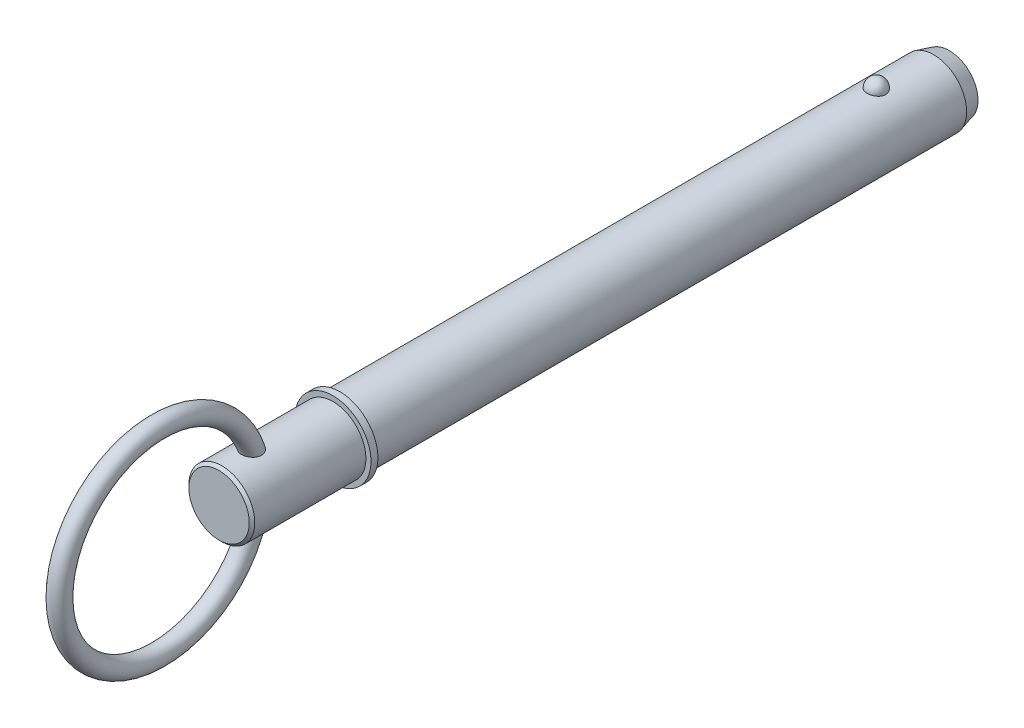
ISO-10303-21;
HEADER;
FILE_DESCRIPTION(('STEP AP214'),'2;1');
FILE_NAME('part.step','',(''),(''),'','','');
FILE_SCHEMA(('AUTOMOTIVE_DESIGN { 1 0 10303 214 1 1 1 1 }'));
ENDSEC;
DATA;
#1=APPLICATION_CONTEXT('core data for automotive mechanical design processes');
#2=APPLICATION_PROTOCOL_DEFINITION('international standard','automotive_design',2000,#1);
#3=PRODUCT_CONTEXT('',#1,'mechanical');
#4=PRODUCT('Part','Part','',(#3));
#5=PRODUCT_RELATED_PRODUCT_CATEGORY('part','',(#4));
#6=PRODUCT_DEFINITION_FORMATION('','',#4);
#7=PRODUCT_DEFINITION_CONTEXT('part definition',#1,'design');
#8=PRODUCT_DEFINITION('design','',#6,#7);
#9=PRODUCT_DEFINITION_SHAPE('','',#8);
#10=(LENGTH_UNIT() NAMED_UNIT(*) SI_UNIT(.MILLI.,.METRE.));
#11=(NAMED_UNIT(*) PLANE_ANGLE_UNIT() SI_UNIT($,.RADIAN.));
#12=(NAMED_UNIT(*) SI_UNIT($,.STERADIAN.) SOLID_ANGLE_UNIT());
#13=UNCERTAINTY_MEASURE_WITH_UNIT(LENGTH_MEASURE(1.E-05),#10,'distance_accuracy_value','');
#14=(GEOMETRIC_REPRESENTATION_CONTEXT(3) GLOBAL_UNCERTAINTY_ASSIGNED_CONTEXT((#13)) GLOBAL_UNIT_ASSIGNED_CONTEXT((#10,
#11,#12)) REPRESENTATION_CONTEXT('',''));
#15=CARTESIAN_POINT('',(0.,0.,0.));
#16=DIRECTION('',(0.,0.,1.));
#17=DIRECTION('',(1.,0.,0.));
#18=AXIS2_PLACEMENT_3D('',#15,#16,#17);
#19=CARTESIAN_POINT('',(0.,0.,152.4));
#20=DIRECTION('',(0.,0.,-1.));
#21=DIRECTION('',(-1.,0.,0.));
#22=AXIS2_PLACEMENT_3D('',#19,#20,#21);
#23=CYLINDRICAL_SURFACE('',#22,9.525);
#24=CARTESIAN_POINT('',(2.66304631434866,9.14515223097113,-2.68999999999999));
#25=CARTESIAN_POINT('',(2.66304388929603,9.14515434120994,-2.53964785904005));
#26=CARTESIAN_POINT('',(2.65079171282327,9.14874785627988,-2.38926509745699));
#27=CARTESIAN_POINT('',(2.60207590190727,9.16272073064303,-2.09276319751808));
#28=CARTESIAN_POINT('',(2.5656035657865,9.17310252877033,-1.94664561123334));
#29=CARTESIAN_POINT('',(2.469373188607,9.19947238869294,-1.66290124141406));
#30=CARTESIAN_POINT('',(2.40962536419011,9.215457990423,-1.52527076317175));
#31=CARTESIAN_POINT('',(2.26832639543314,9.25124900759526,-1.26225231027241));
#32=CARTESIAN_POINT('',(2.1867756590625,9.27105435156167,-1.1368641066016));
#33=CARTESIAN_POINT('',(2.00344089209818,9.3123948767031,-0.901158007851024));
#34=CARTESIAN_POINT('',(1.90155748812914,9.33393823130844,-0.790918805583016));
#35=CARTESIAN_POINT('',(1.68043702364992,9.37626794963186,-0.589299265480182));
#36=CARTESIAN_POINT('',(1.56119995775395,9.397054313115,-0.497918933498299));
#37=CARTESIAN_POINT('',(1.30893044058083,9.43549335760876,-0.336812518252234));
#38=CARTESIAN_POINT('',(1.17593917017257,9.45315498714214,-0.267024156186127));
#39=CARTESIAN_POINT('',(0.899596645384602,9.48344056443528,-0.150749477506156));
#40=CARTESIAN_POINT('',(0.756246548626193,9.49606507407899,-0.104260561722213));
#41=CARTESIAN_POINT('',(0.466048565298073,9.51468193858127,-0.0365733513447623));
#42=CARTESIAN_POINT('',(0.319312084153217,9.52079100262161,-0.0149294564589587));
#43=CARTESIAN_POINT('',(0.0241592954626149,9.52611235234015,0.0039533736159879));
#44=CARTESIAN_POINT('',(-0.12425684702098,9.5253253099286,0.00119468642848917));
#45=CARTESIAN_POINT('',(-0.416281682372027,9.51700443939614,-0.0284230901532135));
#46=CARTESIAN_POINT('',(-0.559928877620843,9.50956858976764,-0.0549321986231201));
#47=CARTESIAN_POINT('',(-0.840604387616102,9.48887888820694,-0.130816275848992));
#48=CARTESIAN_POINT('',(-0.977632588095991,9.47562493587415,-0.180191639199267));
#49=CARTESIAN_POINT('',(-1.24212223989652,9.44460733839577,-0.300803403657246));
#50=CARTESIAN_POINT('',(-1.36952298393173,9.42681774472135,-0.372166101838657));
#51=CARTESIAN_POINT('',(-1.61053183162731,9.38864858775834,-0.534729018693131));
#52=CARTESIAN_POINT('',(-1.72413851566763,9.36826875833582,-0.625931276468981));
#53=CARTESIAN_POINT('',(-1.9367483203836,9.32666137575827,-0.827716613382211));
#54=CARTESIAN_POINT('',(-2.03542624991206,9.3054250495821,-0.938640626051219));
#55=CARTESIAN_POINT('',(-2.21301001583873,9.26480083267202,-1.17562728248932));
#56=CARTESIAN_POINT('',(-2.29191442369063,9.24541307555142,-1.3016910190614));
#57=CARTESIAN_POINT('',(-2.4288038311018,9.21040769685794,-1.56709947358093));
#58=CARTESIAN_POINT('',(-2.48653332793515,9.19483682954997,-1.70658229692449));
#59=CARTESIAN_POINT('',(-2.57830950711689,9.16952722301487,-1.99363485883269));
#60=CARTESIAN_POINT('',(-2.61235688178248,9.1597883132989,-2.14120436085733));
#61=CARTESIAN_POINT('',(-2.65582131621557,9.14728131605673,-2.43957517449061));
#62=CARTESIAN_POINT('',(-2.66534248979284,9.14448376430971,-2.59036007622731));
#63=CARTESIAN_POINT('',(-2.659816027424,9.1460926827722,-2.89143694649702));
#64=CARTESIAN_POINT('',(-2.64476907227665,9.15049895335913,-3.04172892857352));
#65=CARTESIAN_POINT('',(-2.59062526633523,9.16597303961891,-3.3367616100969));
#66=CARTESIAN_POINT('',(-2.55165119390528,9.17700684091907,-3.48152666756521));
#67=CARTESIAN_POINT('',(-2.45072334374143,9.20447158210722,-3.7622672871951));
#68=CARTESIAN_POINT('',(-2.38876863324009,9.22090274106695,-3.89824249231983));
#69=CARTESIAN_POINT('',(-2.24300082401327,9.25744165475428,-4.15838266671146));
#70=CARTESIAN_POINT('',(-2.15906901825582,9.27756919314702,-4.28247834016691));
#71=CARTESIAN_POINT('',(-1.97161008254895,9.31920445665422,-4.51460755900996));
#72=CARTESIAN_POINT('',(-1.86808218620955,9.34071223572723,-4.62264047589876));
#73=CARTESIAN_POINT('',(-1.64365852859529,9.38280712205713,-4.82005417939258));
#74=CARTESIAN_POINT('',(-1.52269814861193,9.40339041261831,-4.90936239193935));
#75=CARTESIAN_POINT('',(-1.26696810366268,9.44124442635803,-5.06628635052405));
#76=CARTESIAN_POINT('',(-1.1321994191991,9.45851538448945,-5.13390363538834));
#77=CARTESIAN_POINT('',(-0.854427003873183,9.48761400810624,-5.24478918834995));
#78=CARTESIAN_POINT('',(-0.711548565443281,9.49950757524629,-5.28835378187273));
#79=CARTESIAN_POINT('',(-0.420167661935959,9.51684639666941,-5.35116010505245));
#80=CARTESIAN_POINT('',(-0.271665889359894,9.52229244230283,-5.3704048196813));
#81=CARTESIAN_POINT('',(0.0236961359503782,9.52609381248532,-5.38387805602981));
#82=CARTESIAN_POINT('',(0.170533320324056,9.52458300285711,-5.37857884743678));
#83=CARTESIAN_POINT('',(0.461166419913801,9.51494050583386,-5.34419624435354));
#84=CARTESIAN_POINT('',(0.604962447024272,9.50680906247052,-5.31511372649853));
#85=CARTESIAN_POINT('',(0.884899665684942,9.48484202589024,-5.23415185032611));
#86=CARTESIAN_POINT('',(1.02106863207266,9.47102889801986,-5.18236222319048));
#87=CARTESIAN_POINT('',(1.28268503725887,9.43915933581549,-5.05742910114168));
#88=CARTESIAN_POINT('',(1.40813178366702,9.421102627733,-4.98428422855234));
#89=CARTESIAN_POINT('',(1.64690915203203,9.38233399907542,-4.8172920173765));
#90=CARTESIAN_POINT('',(1.76002050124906,9.36158508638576,-4.72313982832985));
#91=CARTESIAN_POINT('',(1.96897358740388,9.31987907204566,-4.51732444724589));
#92=CARTESIAN_POINT('',(2.06481234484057,9.29892193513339,-4.40565824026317));
#93=CARTESIAN_POINT('',(2.23837433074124,9.25869342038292,-4.16566572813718));
#94=CARTESIAN_POINT('',(2.31574652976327,9.23945848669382,-4.03707931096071));
#95=CARTESIAN_POINT('',(2.44818540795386,9.20525491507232,-3.76840633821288));
#96=CARTESIAN_POINT('',(2.50325979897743,9.19028480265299,-3.6283237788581));
#97=CARTESIAN_POINT('',(2.58510224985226,9.16757716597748,-3.35610038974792));
#98=CARTESIAN_POINT('',(2.61427951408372,9.15923447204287,-3.2247283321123));
#99=CARTESIAN_POINT('',(2.6532524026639,9.14802112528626,-2.95891229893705));
#100=CARTESIAN_POINT('',(2.66304848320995,9.1451503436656,-2.82446839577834));
#101=CARTESIAN_POINT('',(2.66304631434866,9.14515223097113,-2.68999999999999));
#102=B_SPLINE_CURVE_WITH_KNOTS('',3,(#24,#25,#26,#27,#28,#29,#30,#31,#32,#33,#34,#35,#36,#37,
#38,#39,#40,#41,#42,#43,#44,#45,#46,#47,#48,#49,#50,#51,#52,#53,#54,#55,#56,#57,#58,#59,#60,#61,
#62,#63,#64,#65,#66,#67,#68,#69,#70,#71,#72,#73,#74,#75,#76,#77,#78,#79,#80,#81,#82,#83,#84,#85,
#86,#87,#88,#89,#90,#91,#92,#93,#94,#95,#96,#97,#98,#99,#100,#101),.UNSPECIFIED.,.T.,.F.,(4,2,2,
2,2,2,2,2,2,2,2,2,2,2,2,2,2,2,2,2,2,2,2,2,2,2,2,2,2,2,2,2,2,2,2,2,2,2,4),(0.,0.450573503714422,
0.901308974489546,1.35184682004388,1.80237623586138,2.25516399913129,2.70795190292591,
3.15942136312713,3.61084044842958,4.0540301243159,4.49717661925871,4.9338984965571,
5.37062791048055,5.80991423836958,6.24924573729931,6.69708004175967,7.1449466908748,
7.5980522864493,8.0511446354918,8.50231041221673,8.95346368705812,9.40232106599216,
9.85119666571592,10.3025487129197,10.7539184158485,11.2070064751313,11.6600623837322,
12.1074045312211,12.5546917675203,12.9934085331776,13.4321091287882,13.8690915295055,
14.3061021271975,14.7499227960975,15.1938199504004,15.6455814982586,16.0971866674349,
16.5001694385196,16.9031427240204),.UNSPECIFIED.);
#103=CARTESIAN_POINT('',(2.66304631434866,9.14515223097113,-2.68999999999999));
#104=VERTEX_POINT('',#103);
#105=EDGE_CURVE('E100',#104,#104,#102,.T.);
#106=ORIENTED_EDGE('',*,*,#105,.T.);
#107=EDGE_LOOP('',(#106));
#108=FACE_BOUND('',#107,.T.);
#109=CARTESIAN_POINT('',(0.,0.,-19.3000000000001));
#110=DIRECTION('',(0.,0.,-1.));
#111=DIRECTION('',(-1.,0.,0.));
#112=AXIS2_PLACEMENT_3D('',#109,#110,#111);
#113=CIRCLE('',#112,9.525);
#114=CARTESIAN_POINT('',(-9.525,0.,-19.3000000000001));
#115=VERTEX_POINT('',#114);
#116=EDGE_CURVE('E108',#115,#115,#113,.F.);
#117=ORIENTED_EDGE('',*,*,#116,.T.);
#118=EDGE_LOOP('',(#117));
#119=FACE_BOUND('',#118,.T.);
#120=CARTESIAN_POINT('',(0.,0.,152.4));
#121=DIRECTION('',(0.,0.,1.));
#122=DIRECTION('',(1.,0.,0.));
#123=AXIS2_PLACEMENT_3D('',#120,#121,#122);
#124=CIRCLE('',#123,9.525);
#125=CARTESIAN_POINT('',(9.525,0.,152.4));
#126=VERTEX_POINT('',#125);
#127=EDGE_CURVE('E106',#126,#126,#124,.T.);
#128=ORIENTED_EDGE('',*,*,#127,.F.);
#129=EDGE_LOOP('',(#128));
#130=FACE_BOUND('',#129,.T.);
#131=ADVANCED_FACE('F39',(#108,#119,#130),#23,.T.);
#132=CARTESIAN_POINT('',(0.,0.,-23.8));
#133=DIRECTION('',(0.,0.,-1.));
#134=DIRECTION('',(-1.,0.,0.));
#135=AXIS2_PLACEMENT_3D('',#132,#133,#134);
#136=PLANE('',#135);
#137=CARTESIAN_POINT('',(0.,0.,-23.8));
#138=DIRECTION('',(0.,0.,-1.));
#139=DIRECTION('',(-1.,0.,0.));
#140=AXIS2_PLACEMENT_3D('',#137,#138,#139);
#141=CIRCLE('',#140,8.31922863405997);
#142=CARTESIAN_POINT('',(-8.31922863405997,0.,-23.8));
#143=VERTEX_POINT('',#142);
#144=EDGE_CURVE('E143',#143,#143,#141,.T.);
#145=ORIENTED_EDGE('',*,*,#144,.T.);
#146=EDGE_LOOP('',(#145));
#147=FACE_BOUND('',#146,.T.);
#148=ADVANCED_FACE('F86',(#147),#136,.T.);
#149=CARTESIAN_POINT('',(0.,0.,-23.8));
#150=DIRECTION('',(0.,0.,1.));
#151=DIRECTION('',(1.,0.,0.));
#152=AXIS2_PLACEMENT_3D('',#149,#150,#151);
#153=CONICAL_SURFACE('',#152,8.31922863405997,0.261799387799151);
#154=ORIENTED_EDGE('',*,*,#116,.F.);
#155=EDGE_LOOP('',(#154));
#156=FACE_BOUND('',#155,.T.);
#157=ORIENTED_EDGE('',*,*,#144,.F.);
#158=EDGE_LOOP('',(#157));
#159=FACE_BOUND('',#158,.T.);
#160=ADVANCED_FACE('F92',(#156,#159),#153,.T.);
#161=CARTESIAN_POINT('',(0.,9.525,-2.68999999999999));
#162=DIRECTION('',(0.,1.,0.));
#163=DIRECTION('',(0.,0.,1.));
#164=AXIS2_PLACEMENT_3D('',#161,#162,#163);
#165=SPHERICAL_SURFACE('',#164,2.69);
#166=ORIENTED_EDGE('',*,*,#105,.F.);
#167=EDGE_LOOP('',(#166));
#168=FACE_BOUND('',#167,.T.);
#169=ADVANCED_FACE('F111',(#168),#165,.T.);
#170=CARTESIAN_POINT('',(0.,0.,152.4));
#171=DIRECTION('',(0.,0.,-1.));
#172=DIRECTION('',(-1.,0.,0.));
#173=AXIS2_PLACEMENT_3D('',#170,#171,#172);
#174=PLANE('',#173);
#175=ORIENTED_EDGE('',*,*,#127,.T.);
#176=EDGE_LOOP('',(#175));
#177=FACE_BOUND('',#176,.T.);
#178=CARTESIAN_POINT('',(0.,0.,152.4));
#179=DIRECTION('',(0.,0.,-1.));
#180=DIRECTION('',(-1.,0.,0.));
#181=AXIS2_PLACEMENT_3D('',#178,#179,#180);
#182=CIRCLE('',#181,11.);
#183=CARTESIAN_POINT('',(-11.,0.,152.4));
#184=VERTEX_POINT('',#183);
#185=EDGE_CURVE('E107',#184,#184,#182,.T.);
#186=ORIENTED_EDGE('',*,*,#185,.T.);
#187=EDGE_LOOP('',(#186));
#188=FACE_BOUND('',#187,.T.);
#189=ADVANCED_FACE('F115',(#177,#188),#174,.T.);
#190=CARTESIAN_POINT('',(0.,0.,33.7287874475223));
#191=DIRECTION('',(0.,0.,-1.));
#192=DIRECTION('',(-1.,0.,0.));
#193=AXIS2_PLACEMENT_3D('',#190,#191,#192);
#194=CYLINDRICAL_SURFACE('',#193,11.);
#195=CARTESIAN_POINT('',(0.,0.,154.4));
#196=DIRECTION('',(0.,0.,-1.));
#197=DIRECTION('',(-1.,0.,0.));
#198=AXIS2_PLACEMENT_3D('',#195,#196,#197);
#199=CIRCLE('',#198,11.);
#200=CARTESIAN_POINT('',(-11.,0.,154.4));
#201=VERTEX_POINT('',#200);
#202=EDGE_CURVE('E132',#201,#201,#199,.T.);
#203=ORIENTED_EDGE('',*,*,#202,.T.);
#204=EDGE_LOOP('',(#203));
#205=FACE_BOUND('',#204,.T.);
#206=ORIENTED_EDGE('',*,*,#185,.F.);
#207=EDGE_LOOP('',(#206));
#208=FACE_BOUND('',#207,.T.);
#209=ADVANCED_FACE('F119',(#205,#208),#194,.T.);
#210=CARTESIAN_POINT('',(0.,11.,154.4));
#211=DIRECTION('',(0.,0.,1.));
#212=DIRECTION('',(1.,0.,0.));
#213=AXIS2_PLACEMENT_3D('',#210,#211,#212);
#214=PLANE('',#213);
#215=CARTESIAN_POINT('',(0.,0.,154.4));
#216=DIRECTION('',(0.,0.,1.));
#217=DIRECTION('',(1.,0.,0.));
#218=AXIS2_PLACEMENT_3D('',#215,#216,#217);
#219=CIRCLE('',#218,9.525);
#220=CARTESIAN_POINT('',(9.525,0.,154.4));
#221=VERTEX_POINT('',#220);
#222=EDGE_CURVE('E110',#221,#221,#219,.T.);
#223=ORIENTED_EDGE('',*,*,#222,.F.);
#224=EDGE_LOOP('',(#223));
#225=FACE_BOUND('',#224,.T.);
#226=ORIENTED_EDGE('',*,*,#202,.F.);
#227=EDGE_LOOP('',(#226));
#228=FACE_BOUND('',#227,.T.);
#229=ADVANCED_FACE('F83',(#225,#228),#214,.T.);
#230=CARTESIAN_POINT('',(0.,0.,187.33));
#231=DIRECTION('',(0.,0.,-1.));
#232=DIRECTION('',(-1.,0.,0.));
#233=AXIS2_PLACEMENT_3D('',#230,#231,#232);
#234=CYLINDRICAL_SURFACE('',#233,9.525);
#235=CARTESIAN_POINT('',(-1.1725502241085,-9.45255262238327,175.315681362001));
#236=CARTESIAN_POINT('',(-1.03279041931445,-9.46988901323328,175.252058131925));
#237=CARTESIAN_POINT('',(-0.887457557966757,-9.48474288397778,175.200036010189));
#238=CARTESIAN_POINT('',(-0.589790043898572,-9.50789357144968,175.120301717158));
#239=CARTESIAN_POINT('',(-0.437456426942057,-9.51619135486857,175.092585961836));
#240=CARTESIAN_POINT('',(-0.130095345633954,-9.52535230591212,175.062037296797));
#241=CARTESIAN_POINT('',(0.0249321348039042,-9.52621542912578,175.059204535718));
#242=CARTESIAN_POINT('',(0.333291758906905,-9.5204161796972,175.078480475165));
#243=CARTESIAN_POINT('',(0.486623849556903,-9.51375357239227,175.100589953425));
#244=CARTESIAN_POINT('',(0.787326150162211,-9.49360162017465,175.169309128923));
#245=CARTESIAN_POINT('',(0.934692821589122,-9.48010828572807,175.215933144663));
#246=CARTESIAN_POINT('',(1.21917062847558,-9.44773819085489,175.332695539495));
#247=CARTESIAN_POINT('',(1.3562816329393,-9.42886136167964,175.402834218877));
#248=CARTESIAN_POINT('',(1.61597534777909,-9.38783836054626,175.564858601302));
#249=CARTESIAN_POINT('',(1.7385930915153,-9.36570037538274,175.656690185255));
#250=CARTESIAN_POINT('',(1.96611924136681,-9.32059424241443,175.859983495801));
#251=CARTESIAN_POINT('',(2.07103000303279,-9.29762620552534,175.971442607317));
#252=CARTESIAN_POINT('',(2.25895856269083,-9.25375378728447,176.209567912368));
#253=CARTESIAN_POINT('',(2.3422308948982,-9.23282741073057,176.336029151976));
#254=CARTESIAN_POINT('',(2.48638570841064,-9.19505802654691,176.601654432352));
#255=CARTESIAN_POINT('',(2.54727152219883,-9.17821441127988,176.740816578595));
#256=CARTESIAN_POINT('',(2.64504150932,-9.15051673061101,177.026450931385));
#257=CARTESIAN_POINT('',(2.68213620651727,-9.13961026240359,177.17284631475));
#258=CARTESIAN_POINT('',(2.73308631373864,-9.1245038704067,177.469935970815));
#259=CARTESIAN_POINT('',(2.74693762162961,-9.12030513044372,177.620630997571));
#260=CARTESIAN_POINT('',(2.75225289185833,-9.11870262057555,177.928204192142));
#261=CARTESIAN_POINT('',(2.742835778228,-9.12156626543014,178.085097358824));
#262=CARTESIAN_POINT('',(2.70120500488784,-9.1339786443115,178.395530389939));
#263=CARTESIAN_POINT('',(2.6689831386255,-9.14352978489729,178.549069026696));
#264=CARTESIAN_POINT('',(2.57915721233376,-9.1692947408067,178.864317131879));
#265=CARTESIAN_POINT('',(2.51938387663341,-9.18606757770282,179.02536274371));
#266=CARTESIAN_POINT('',(2.37615490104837,-9.22415241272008,179.336112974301));
#267=CARTESIAN_POINT('',(2.2926764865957,-9.2454687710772,179.485806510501));
#268=CARTESIAN_POINT('',(2.09570343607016,-9.29218719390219,179.782005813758));
#269=CARTESIAN_POINT('',(1.98029238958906,-9.3177815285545,179.927215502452));
#270=CARTESIAN_POINT('',(1.72523060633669,-9.36835235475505,180.194631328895));
#271=CARTESIAN_POINT('',(1.58560973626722,-9.39332956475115,180.31686542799));
#272=CARTESIAN_POINT('',(1.31999418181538,-9.43381163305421,180.506542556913));
#273=CARTESIAN_POINT('',(1.19849876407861,-9.45016352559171,180.580111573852));
#274=CARTESIAN_POINT('',(0.944726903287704,-9.47889043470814,180.706555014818));
#275=CARTESIAN_POINT('',(0.812460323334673,-9.4912690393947,180.75944811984));
#276=CARTESIAN_POINT('',(0.539385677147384,-9.51070487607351,180.841579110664));
#277=CARTESIAN_POINT('',(0.398529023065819,-9.51772807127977,180.870665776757));
#278=CARTESIAN_POINT('',(0.113692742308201,-9.52538430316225,180.90234627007));
#279=CARTESIAN_POINT('',(-0.0302854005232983,-9.52602031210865,180.904952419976));
#280=CARTESIAN_POINT('',(-0.301067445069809,-9.52110324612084,180.884638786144));
#281=CARTESIAN_POINT('',(-0.428091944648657,-9.51619084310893,180.864361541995));
#282=CARTESIAN_POINT('',(-0.676960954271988,-9.50173118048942,180.803770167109));
#283=CARTESIAN_POINT('',(-0.79880468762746,-9.49218322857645,180.763453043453));
#284=CARTESIAN_POINT('',(-1.03743276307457,-9.4691126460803,180.663797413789));
#285=CARTESIAN_POINT('',(-1.15402581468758,-9.45550022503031,180.604026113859));
#286=CARTESIAN_POINT('',(-1.37707059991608,-9.42560278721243,180.468465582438));
#287=CARTESIAN_POINT('',(-1.48351822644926,-9.40931669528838,180.392669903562));
#288=CARTESIAN_POINT('',(-1.70022776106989,-9.37276249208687,180.215206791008));
#289=CARTESIAN_POINT('',(-1.80866644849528,-9.35226352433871,180.111363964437));
#290=CARTESIAN_POINT('',(-2.00947431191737,-9.31118474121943,179.88916467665));
#291=CARTESIAN_POINT('',(-2.10183201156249,-9.29060487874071,179.770797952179));
#292=CARTESIAN_POINT('',(-2.28343646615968,-9.24779116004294,179.501723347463));
#293=CARTESIAN_POINT('',(-2.36963977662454,-9.22584708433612,179.348904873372));
#294=CARTESIAN_POINT('',(-2.51731958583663,-9.18665215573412,179.031108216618));
#295=CARTESIAN_POINT('',(-2.57878214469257,-9.16940395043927,178.866123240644));
#296=CARTESIAN_POINT('',(-2.67771284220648,-9.14102404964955,178.517906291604));
#297=CARTESIAN_POINT('',(-2.71355979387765,-9.13031106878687,178.334171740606));
#298=CARTESIAN_POINT('',(-2.75239325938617,-9.11868499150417,177.962939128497));
#299=CARTESIAN_POINT('',(-2.75540326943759,-9.11776488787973,177.775443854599));
#300=CARTESIAN_POINT('',(-2.72755769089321,-9.12612848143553,177.418233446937));
#301=CARTESIAN_POINT('',(-2.69938579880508,-9.1346036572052,177.248293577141));
#302=CARTESIAN_POINT('',(-2.6128234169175,-9.15973790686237,176.91694195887));
#303=CARTESIAN_POINT('',(-2.55445306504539,-9.17639152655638,176.755524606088));
#304=CARTESIAN_POINT('',(-2.41575064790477,-9.21381352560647,176.462262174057));
#305=CARTESIAN_POINT('',(-2.33810564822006,-9.23402440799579,176.329067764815));
#306=CARTESIAN_POINT('',(-2.1611059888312,-9.27704240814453,176.078436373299));
#307=CARTESIAN_POINT('',(-2.06174995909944,-9.29984968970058,175.96100038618));
#308=CARTESIAN_POINT('',(-1.84046167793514,-9.3462023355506,175.741444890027));
#309=CARTESIAN_POINT('',(-1.71787459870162,-9.36974632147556,175.63998498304));
#310=CARTESIAN_POINT('',(-1.45637301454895,-9.41393415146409,175.460085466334));
#311=CARTESIAN_POINT('',(-1.31745717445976,-9.43457775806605,175.381647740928));
#312=CARTESIAN_POINT('',(-1.1725502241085,-9.45255262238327,175.315681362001));
#313=B_SPLINE_CURVE_WITH_KNOTS('',3,(#235,#236,#237,#238,#239,#240,#241,#242,#243,#244,#245,
#246,#247,#248,#249,#250,#251,#252,#253,#254,#255,#256,#257,#258,#259,#260,#261,#262,#263,#264,
#265,#266,#267,#268,#269,#270,#271,#272,#273,#274,#275,#276,#277,#278,#279,#280,#281,#282,#283,
#284,#285,#286,#287,#288,#289,#290,#291,#292,#293,#294,#295,#296,#297,#298,#299,#300,#301,#302,
#303,#304,#305,#306,#307,#308,#309,#310,#311,#312),.UNSPECIFIED.,.T.,.F.,(4,2,2,2,2,2,2,2,2,2,2,
2,2,2,2,2,2,2,2,2,2,2,2,2,2,2,2,2,2,2,2,2,2,2,2,2,2,2,4),(0.,0.463035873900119,
0.926003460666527,1.38897381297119,1.85195860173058,2.31521411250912,2.77847553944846,
3.24059321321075,3.7026493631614,4.1589953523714,4.61527338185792,5.06745604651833,
5.51971850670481,5.98936669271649,6.45918397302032,6.97482863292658,7.49097038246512,
8.04995658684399,8.60825803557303,9.03545685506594,9.46226879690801,9.89177127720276,
10.3210738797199,10.7054535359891,11.0898906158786,11.4835430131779,11.877354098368,
12.3302409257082,12.7834496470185,13.3116493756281,13.8401462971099,14.3996817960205,
14.9588168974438,15.4733264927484,15.9874934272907,16.4516692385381,16.915874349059,
17.3959238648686,17.8760126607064),.UNSPECIFIED.);
#314=CARTESIAN_POINT('',(-1.1725502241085,-9.45255262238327,175.315681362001));
#315=VERTEX_POINT('',#314);
#316=EDGE_CURVE('E10',#315,#315,#313,.T.);
#317=ORIENTED_EDGE('',*,*,#316,.F.);
#318=EDGE_LOOP('',(#317));
#319=FACE_BOUND('',#318,.T.);
#320=CARTESIAN_POINT('',(-1.1725502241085,9.45255262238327,175.315681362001));
#321=CARTESIAN_POINT('',(-1.31058061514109,9.43543238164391,175.378514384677));
#322=CARTESIAN_POINT('',(-1.44315063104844,9.41589375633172,175.452651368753));
#323=CARTESIAN_POINT('',(-1.6936534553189,9.37407591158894,175.621892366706));
#324=CARTESIAN_POINT('',(-1.81158925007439,9.35179725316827,175.716992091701));
#325=CARTESIAN_POINT('',(-2.02956633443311,9.30692788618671,175.92596768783));
#326=CARTESIAN_POINT('',(-2.12959463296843,9.28433696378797,176.039857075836));
#327=CARTESIAN_POINT('',(-2.30883055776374,9.24139869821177,176.28334578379));
#328=CARTESIAN_POINT('',(-2.38804080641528,9.22105107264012,176.412943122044));
#329=CARTESIAN_POINT('',(-2.52289811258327,9.18506690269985,176.682637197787));
#330=CARTESIAN_POINT('',(-2.57879510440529,9.16938093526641,176.822602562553));
#331=CARTESIAN_POINT('',(-2.66732862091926,9.14402087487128,177.110194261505));
#332=CARTESIAN_POINT('',(-2.69996436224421,9.13434698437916,177.257820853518));
#333=CARTESIAN_POINT('',(-2.74234854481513,9.12171311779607,177.558709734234));
#334=CARTESIAN_POINT('',(-2.75176419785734,9.11885078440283,177.712022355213));
#335=CARTESIAN_POINT('',(-2.74768995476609,9.12007747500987,178.018282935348));
#336=CARTESIAN_POINT('',(-2.73419331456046,9.12416854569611,178.171230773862));
#337=CARTESIAN_POINT('',(-2.68381401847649,9.13911977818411,178.485048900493));
#338=CARTESIAN_POINT('',(-2.64520186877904,9.15047943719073,178.645615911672));
#339=CARTESIAN_POINT('',(-2.54485320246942,9.17889121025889,178.958878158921));
#340=CARTESIAN_POINT('',(-2.48309922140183,9.19594762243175,179.111567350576));
#341=CARTESIAN_POINT('',(-2.3305691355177,9.23584987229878,179.421122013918));
#342=CARTESIAN_POINT('',(-2.23745101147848,9.25911216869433,179.576784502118));
#343=CARTESIAN_POINT('',(-2.02674425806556,9.30750138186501,179.870279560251));
#344=CARTESIAN_POINT('',(-1.90916388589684,9.33262766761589,180.008118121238));
#345=CARTESIAN_POINT('',(-1.67044606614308,9.37804498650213,180.242015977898));
#346=CARTESIAN_POINT('',(-1.5524387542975,9.39849934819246,180.341240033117));
#347=CARTESIAN_POINT('',(-1.30125310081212,9.43654625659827,180.519193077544));
#348=CARTESIAN_POINT('',(-1.16808326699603,9.45414039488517,180.597933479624));
#349=CARTESIAN_POINT('',(-0.958516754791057,9.47691412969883,180.697606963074));
#350=CARTESIAN_POINT('',(-0.886649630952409,9.48392776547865,180.727860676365));
#351=CARTESIAN_POINT('',(-0.740281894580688,9.49647248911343,180.781484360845));
#352=CARTESIAN_POINT('',(-0.665782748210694,9.50200438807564,180.804858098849));
#353=CARTESIAN_POINT('',(-0.514804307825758,9.51137811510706,180.8442294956));
#354=CARTESIAN_POINT('',(-0.438326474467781,9.51522115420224,180.860232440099));
#355=CARTESIAN_POINT('',(-0.284116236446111,9.52107513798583,180.884532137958));
#356=CARTESIAN_POINT('',(-0.206384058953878,9.52308641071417,180.892830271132));
#357=CARTESIAN_POINT('',(0.00463957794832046,9.5259225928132,180.90454519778));
#358=CARTESIAN_POINT('',(0.138460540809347,9.52491109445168,180.900394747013));
#359=CARTESIAN_POINT('',(0.40315259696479,9.51738801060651,180.869251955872));
#360=CARTESIAN_POINT('',(0.534023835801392,9.51087669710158,180.842260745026));
#361=CARTESIAN_POINT('',(0.783985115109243,9.49347484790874,180.768806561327));
#362=CARTESIAN_POINT('',(0.903337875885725,9.48277338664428,180.723181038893));
#363=CARTESIAN_POINT('',(1.13363663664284,9.45800893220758,180.614928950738));
#364=CARTESIAN_POINT('',(1.24458027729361,9.44394500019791,180.552297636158));
#365=CARTESIAN_POINT('',(1.46880911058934,9.41182796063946,180.404389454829));
#366=CARTESIAN_POINT('',(1.58087386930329,9.39350137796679,180.317328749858));
#367=CARTESIAN_POINT('',(1.79132420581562,9.35565274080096,180.128247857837));
#368=CARTESIAN_POINT('',(1.88970126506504,9.33612995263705,180.026218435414));
#369=CARTESIAN_POINT('',(2.08778125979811,9.29401761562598,179.790997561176));
#370=CARTESIAN_POINT('',(2.18473298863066,9.27148591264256,179.65547341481));
#371=CARTESIAN_POINT('',(2.35733954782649,9.22911075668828,179.371030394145));
#372=CARTESIAN_POINT('',(2.43297838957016,9.20926932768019,179.222101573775));
#373=CARTESIAN_POINT('',(2.56843139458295,9.17247322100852,178.897269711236));
#374=CARTESIAN_POINT('',(2.62561924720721,9.15606955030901,178.720196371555));
#375=CARTESIAN_POINT('',(2.70930664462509,9.13166037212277,178.358330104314));
#376=CARTESIAN_POINT('',(2.73581406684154,9.12365270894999,178.173539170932));
#377=CARTESIAN_POINT('',(2.7551261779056,9.11784049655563,177.809017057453));
#378=CARTESIAN_POINT('',(2.74917791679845,9.11965839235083,177.629361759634));
#379=CARTESIAN_POINT('',(2.7047327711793,9.13294027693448,177.274499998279));
#380=CARTESIAN_POINT('',(2.66626406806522,9.14439591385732,177.099289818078));
#381=CARTESIAN_POINT('',(2.56263844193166,9.17393184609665,176.778469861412));
#382=CARTESIAN_POINT('',(2.50080069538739,9.19116614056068,176.631704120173));
#383=CARTESIAN_POINT('',(2.35244847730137,9.23024728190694,176.35189992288));
#384=CARTESIAN_POINT('',(2.26593972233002,9.25209305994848,176.218858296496));
#385=CARTESIAN_POINT('',(2.07585352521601,9.29652853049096,175.977145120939));
#386=CARTESIAN_POINT('',(1.97340753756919,9.31901931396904,175.867562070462));
#387=CARTESIAN_POINT('',(1.75142335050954,9.36327537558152,175.667179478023));
#388=CARTESIAN_POINT('',(1.63188535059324,9.3850406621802,175.576379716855));
#389=CARTESIAN_POINT('',(1.37826267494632,9.42563474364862,175.415168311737));
#390=CARTESIAN_POINT('',(1.24409194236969,9.44444438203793,175.344887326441));
#391=CARTESIAN_POINT('',(0.965562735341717,9.4769701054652,175.226996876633));
#392=CARTESIAN_POINT('',(0.821203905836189,9.49068601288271,175.179388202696));
#393=CARTESIAN_POINT('',(0.524366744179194,9.51173338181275,175.107369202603));
#394=CARTESIAN_POINT('',(0.371807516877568,9.5189799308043,175.083267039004));
#395=CARTESIAN_POINT('',(0.0646112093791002,9.52602042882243,175.059842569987));
#396=CARTESIAN_POINT('',(-0.0900262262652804,9.52581308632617,175.060524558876));
#397=CARTESIAN_POINT('',(-0.404139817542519,9.51777767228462,175.087276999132));
#398=CARTESIAN_POINT('',(-0.56350821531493,9.50959696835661,175.11452226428));
#399=CARTESIAN_POINT('',(-0.874799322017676,9.48602809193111,175.195533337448));
#400=CARTESIAN_POINT('',(-1.0267221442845,9.47064002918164,175.24929874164));
#401=CARTESIAN_POINT('',(-1.1725502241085,9.45255262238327,175.315681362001));
#402=B_SPLINE_CURVE_WITH_KNOTS('',3,(#320,#321,#322,#323,#324,#325,#326,#327,#328,#329,#330,
#331,#332,#333,#334,#335,#336,#337,#338,#339,#340,#341,#342,#343,#344,#345,#346,#347,#348,#349,
#350,#351,#352,#353,#354,#355,#356,#357,#358,#359,#360,#361,#362,#363,#364,#365,#366,#367,#368,
#369,#370,#371,#372,#373,#374,#375,#376,#377,#378,#379,#380,#381,#382,#383,#384,#385,#386,#387,
#388,#389,#390,#391,#392,#393,#394,#395,#396,#397,#398,#399,#400,#401),.UNSPECIFIED.,.T.,.F.,(4,
2,2,2,2,2,2,2,2,2,2,2,2,2,2,2,2,2,2,2,2,2,2,2,2,2,2,2,2,2,2,2,2,2,2,2,2,2,2,2,4),(0.,
0.457306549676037,0.914519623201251,1.37206305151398,1.82954881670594,2.28199545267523,
2.73445732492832,3.19336710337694,3.65241198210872,4.14699278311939,4.64194758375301,
5.18812269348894,5.734113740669,6.19889752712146,6.66342179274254,6.89799214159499,
7.13243382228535,7.3667071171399,7.60093844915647,8.0003243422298,8.3996904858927,
8.78279802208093,9.1660126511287,9.59366701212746,10.0215863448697,10.5240084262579,
11.0268064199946,11.5844522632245,12.1419548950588,12.6781910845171,13.213963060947,
13.6920531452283,14.1700325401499,14.6229745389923,15.0759112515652,15.5316722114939,
15.9874490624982,16.4491237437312,16.91087841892,17.3940267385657,17.8771677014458),.UNSPECIFIED.);
#403=CARTESIAN_POINT('',(-1.1725502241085,9.45255262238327,175.315681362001));
#404=VERTEX_POINT('',#403);
#405=EDGE_CURVE('E51',#404,#404,#402,.T.);
#406=ORIENTED_EDGE('',*,*,#405,.F.);
#407=EDGE_LOOP('',(#406));
#408=FACE_BOUND('',#407,.T.);
#409=CARTESIAN_POINT('',(0.,0.,186.53));
#410=DIRECTION('',(0.,0.,-1.));
#411=DIRECTION('',(-1.,0.,0.));
#412=AXIS2_PLACEMENT_3D('',#409,#410,#411);
#413=CIRCLE('',#412,9.525);
#414=CARTESIAN_POINT('',(-9.525,0.,186.53));
#415=VERTEX_POINT('',#414);
#416=EDGE_CURVE('E62',#415,#415,#413,.T.);
#417=ORIENTED_EDGE('',*,*,#416,.T.);
#418=EDGE_LOOP('',(#417));
#419=FACE_BOUND('',#418,.T.);
#420=ORIENTED_EDGE('',*,*,#222,.T.);
#421=EDGE_LOOP('',(#420));
#422=FACE_BOUND('',#421,.T.);
#423=ADVANCED_FACE('F67',(#319,#408,#419,#422),#234,.T.);
#424=CARTESIAN_POINT('',(0.,0.,187.33));
#425=DIRECTION('',(0.,0.,-1.));
#426=DIRECTION('',(-1.,0.,0.));
#427=AXIS2_PLACEMENT_3D('',#424,#425,#426);
#428=PLANE('',#427);
#429=CARTESIAN_POINT('',(0.,0.,187.33));
#430=DIRECTION('',(0.,0.,-1.));
#431=DIRECTION('',(-1.,0.,0.));
#432=AXIS2_PLACEMENT_3D('',#429,#430,#431);
#433=CIRCLE('',#432,8.72500000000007);
#434=CARTESIAN_POINT('',(-8.72500000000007,0.,187.33));
#435=VERTEX_POINT('',#434);
#436=EDGE_CURVE('E57',#435,#435,#433,.F.);
#437=ORIENTED_EDGE('',*,*,#436,.T.);
#438=EDGE_LOOP('',(#437));
#439=FACE_BOUND('',#438,.T.);
#440=ADVANCED_FACE('F74',(#439),#428,.F.);
#441=CARTESIAN_POINT('',(0.,0.,186.53));
#442=DIRECTION('',(0.,0.,-1.));
#443=DIRECTION('',(-1.,0.,0.));
#444=AXIS2_PLACEMENT_3D('',#441,#442,#443);
#445=CONICAL_SURFACE('',#444,9.525,0.785398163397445);
#446=ORIENTED_EDGE('',*,*,#436,.F.);
#447=EDGE_LOOP('',(#446));
#448=FACE_BOUND('',#447,.T.);
#449=ORIENTED_EDGE('',*,*,#416,.F.);
#450=EDGE_LOOP('',(#449));
#451=FACE_BOUND('',#450,.T.);
#452=ADVANCED_FACE('F41',(#448,#451),#445,.T.);
#453=CARTESIAN_POINT('',(0.,0.,204.905));
#454=DIRECTION('',(1.,0.,0.));
#455=DIRECTION('',(0.,0.,-1.));
#456=AXIS2_PLACEMENT_3D('',#453,#454,#455);
#457=TOROIDAL_SURFACE('',#456,28.575,2.75);
#458=ORIENTED_EDGE('',*,*,#316,.T.);
#459=EDGE_LOOP('',(#458));
#460=FACE_BOUND('',#459,.T.);
#461=ORIENTED_EDGE('',*,*,#405,.T.);
#462=EDGE_LOOP('',(#461));
#463=FACE_BOUND('',#462,.T.);
#464=ADVANCED_FACE('F71',(#460,#463),#457,.T.);
#465=CLOSED_SHELL('',(#131,#148,#160,#169,#189,#209,#229,#423,#440,#452,#464));
#466=MANIFOLD_SOLID_BREP('B2',#465);
#467=ADVANCED_BREP_SHAPE_REPRESENTATION('',(#18,#466),#14);
#468=SHAPE_DEFINITION_REPRESENTATION(#9,#467);
ENDSEC;
END-ISO-10303-21;
